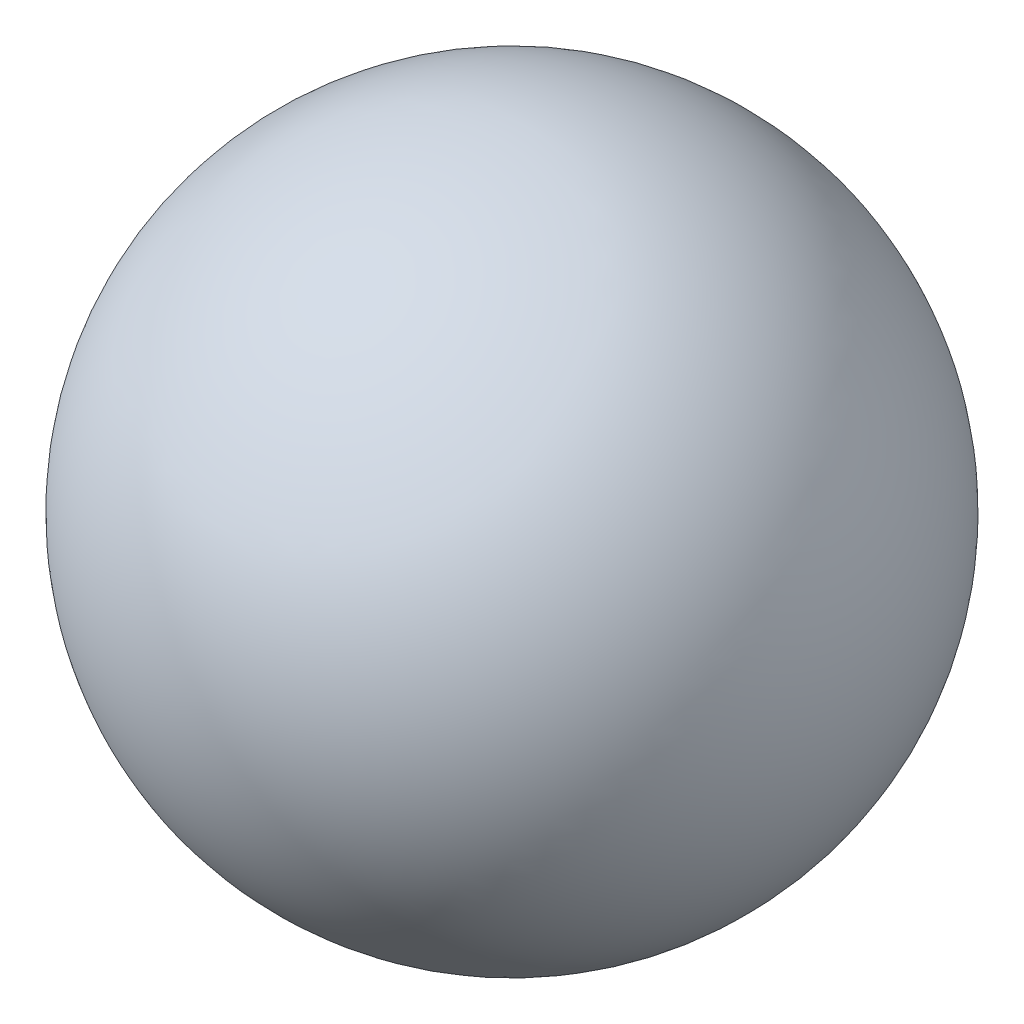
from build123d import *


with BuildPart() as part:
    # Croquis1 → Revoluci_n1 (revolve)
    with BuildSketch(Plane(origin=(0, 0, 0), x_dir=(0, 0, -1), z_dir=(1, 0, 0))):
        with BuildLine():
            Line((0, 0), (140, 0))
            ThreePointArc((140, 0), (70, 70), (0, 0))
        make_face()
    revolve(axis=Axis((0, 0, 0), (0, 0, -1)))


solid = part.part
